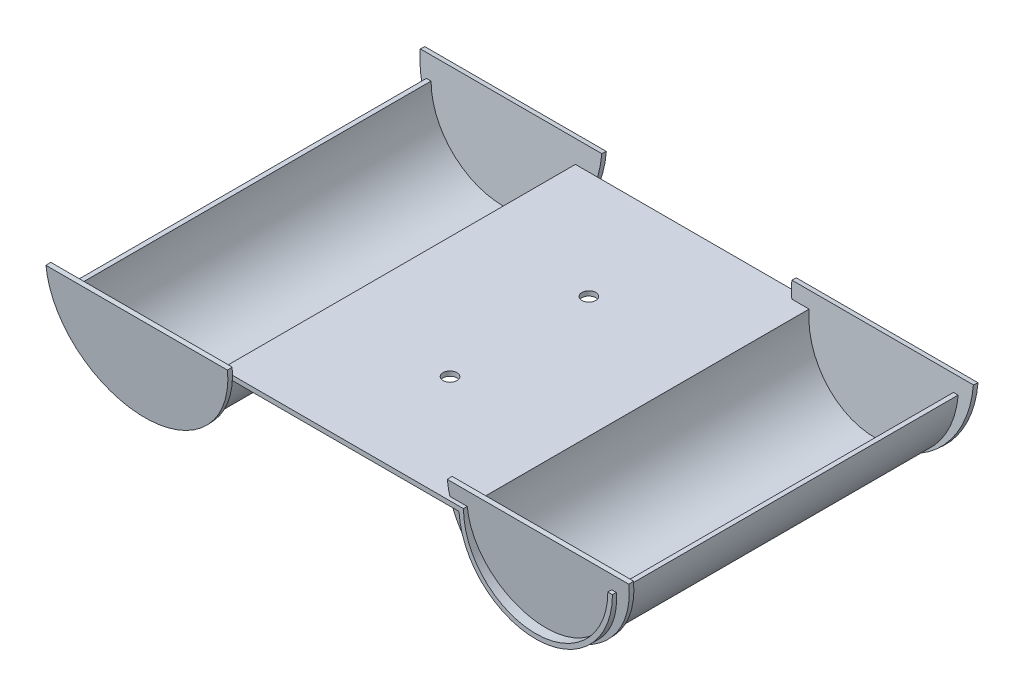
ISO-10303-21;
HEADER;
FILE_DESCRIPTION(('STEP AP214'),'2;1');
FILE_NAME('part.step','',(''),(''),'','','');
FILE_SCHEMA(('AUTOMOTIVE_DESIGN { 1 0 10303 214 1 1 1 1 }'));
ENDSEC;
DATA;
#1=APPLICATION_CONTEXT('core data for automotive mechanical design processes');
#2=APPLICATION_PROTOCOL_DEFINITION('international standard','automotive_design',2000,#1);
#3=PRODUCT_CONTEXT('',#1,'mechanical');
#4=PRODUCT('Part','Part','',(#3));
#5=PRODUCT_RELATED_PRODUCT_CATEGORY('part','',(#4));
#6=PRODUCT_DEFINITION_FORMATION('','',#4);
#7=PRODUCT_DEFINITION_CONTEXT('part definition',#1,'design');
#8=PRODUCT_DEFINITION('design','',#6,#7);
#9=PRODUCT_DEFINITION_SHAPE('','',#8);
#10=(LENGTH_UNIT() NAMED_UNIT(*) SI_UNIT(.MILLI.,.METRE.));
#11=(NAMED_UNIT(*) PLANE_ANGLE_UNIT() SI_UNIT($,.RADIAN.));
#12=(NAMED_UNIT(*) SI_UNIT($,.STERADIAN.) SOLID_ANGLE_UNIT());
#13=UNCERTAINTY_MEASURE_WITH_UNIT(LENGTH_MEASURE(1.E-05),#10,'distance_accuracy_value','');
#14=(GEOMETRIC_REPRESENTATION_CONTEXT(3) GLOBAL_UNCERTAINTY_ASSIGNED_CONTEXT((#13)) GLOBAL_UNIT_ASSIGNED_CONTEXT((#10,
#11,#12)) REPRESENTATION_CONTEXT('',''));
#15=CARTESIAN_POINT('',(0.,0.,0.));
#16=DIRECTION('',(0.,0.,1.));
#17=DIRECTION('',(1.,0.,0.));
#18=AXIS2_PLACEMENT_3D('',#15,#16,#17);
#19=CARTESIAN_POINT('',(114.685600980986,0.,76.5));
#20=DIRECTION('',(0.,-1.,0.));
#21=DIRECTION('',(1.,0.,0.));
#22=AXIS2_PLACEMENT_3D('',#19,#20,#21);
#23=PLANE('',#22);
#24=DIRECTION('',(0.,0.,-1.));
#25=VECTOR('',#24,1.);
#26=CARTESIAN_POINT('',(114.685600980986,0.,76.5));
#27=LINE('',#26,#25);
#28=CARTESIAN_POINT('',(114.685600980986,0.,-74.8532907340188));
#29=VERTEX_POINT('',#28);
#30=CARTESIAN_POINT('',(114.685600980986,0.,-76.5));
#31=VERTEX_POINT('',#30);
#32=EDGE_CURVE('E457',#29,#31,#27,.T.);
#33=ORIENTED_EDGE('',*,*,#32,.F.);
#34=DIRECTION('',(1.,0.,0.));
#35=VECTOR('',#34,1.);
#36=CARTESIAN_POINT('',(114.685600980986,0.,-74.8532907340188));
#37=LINE('',#36,#35);
#38=CARTESIAN_POINT('',(116.685600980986,0.,-74.8532907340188));
#39=VERTEX_POINT('',#38);
#40=EDGE_CURVE('E533',#29,#39,#37,.T.);
#41=ORIENTED_EDGE('',*,*,#40,.T.);
#42=DIRECTION('',(0.,0.,-1.));
#43=VECTOR('',#42,1.);
#44=CARTESIAN_POINT('',(116.685600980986,0.,76.5));
#45=LINE('',#44,#43);
#46=CARTESIAN_POINT('',(116.685600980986,0.,-76.5));
#47=VERTEX_POINT('',#46);
#48=EDGE_CURVE('E462',#39,#47,#45,.T.);
#49=ORIENTED_EDGE('',*,*,#48,.T.);
#50=DIRECTION('',(-1.,0.,0.));
#51=VECTOR('',#50,1.);
#52=CARTESIAN_POINT('',(114.685600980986,0.,-76.5));
#53=LINE('',#52,#51);
#54=EDGE_CURVE('E425',#47,#31,#53,.T.);
#55=ORIENTED_EDGE('',*,*,#54,.T.);
#56=EDGE_LOOP('',(#33,#41,#49,#55));
#57=FACE_BOUND('',#56,.T.);
#58=ADVANCED_FACE('F29',(#57),#23,.F.);
#59=CARTESIAN_POINT('',(83.5,0.,76.5));
#60=DIRECTION('',(0.,0.,-1.));
#61=DIRECTION('',(-1.,0.,0.));
#62=AXIS2_PLACEMENT_3D('',#59,#60,#61);
#63=CYLINDRICAL_SURFACE('',#62,31.1856009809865);
#64=DIRECTION('',(0.,0.,-1.));
#65=VECTOR('',#64,1.);
#66=CARTESIAN_POINT('',(52.3143990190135,0.,76.5));
#67=LINE('',#66,#65);
#68=CARTESIAN_POINT('',(52.3143990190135,0.,-74.8532907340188));
#69=VERTEX_POINT('',#68);
#70=CARTESIAN_POINT('',(52.3143990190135,0.,-76.5));
#71=VERTEX_POINT('',#70);
#72=EDGE_CURVE('E453',#69,#71,#67,.T.);
#73=ORIENTED_EDGE('',*,*,#72,.F.);
#74=CARTESIAN_POINT('',(83.5,0.,-74.8532907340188));
#75=DIRECTION('',(0.,-0.0871557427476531,-0.996194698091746));
#76=DIRECTION('',(0.,0.996194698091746,-0.0871557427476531));
#77=AXIS2_PLACEMENT_3D('',#74,#75,#76);
#78=ELLIPSE('',#77,31.3047249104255,31.1856009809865);
#79=EDGE_CURVE('E530',#69,#29,#78,.F.);
#80=ORIENTED_EDGE('',*,*,#79,.T.);
#81=ORIENTED_EDGE('',*,*,#32,.T.);
#82=CARTESIAN_POINT('',(83.5,0.,-76.5));
#83=DIRECTION('',(0.,0.,-1.));
#84=DIRECTION('',(1.,0.,0.));
#85=AXIS2_PLACEMENT_3D('',#82,#83,#84);
#86=CIRCLE('',#85,31.1856009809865);
#87=EDGE_CURVE('E428',#31,#71,#86,.T.);
#88=ORIENTED_EDGE('',*,*,#87,.T.);
#89=EDGE_LOOP('',(#73,#80,#81,#88));
#90=FACE_BOUND('',#89,.T.);
#91=ADVANCED_FACE('F619',(#90),#63,.F.);
#92=CARTESIAN_POINT('',(116.685600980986,0.,76.5));
#93=VERTEX_POINT('',#92);
#94=CARTESIAN_POINT('',(116.685600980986,0.,74.8532907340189));
#95=VERTEX_POINT('',#94);
#96=EDGE_CURVE('E464',#93,#95,#45,.T.);
#97=ORIENTED_EDGE('',*,*,#96,.T.);
#98=DIRECTION('',(-1.,0.,0.));
#99=VECTOR('',#98,1.);
#100=CARTESIAN_POINT('',(114.685600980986,0.,74.8532907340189));
#101=LINE('',#100,#99);
#102=CARTESIAN_POINT('',(114.685600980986,0.,74.8532907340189));
#103=VERTEX_POINT('',#102);
#104=EDGE_CURVE('E364',#95,#103,#101,.T.);
#105=ORIENTED_EDGE('',*,*,#104,.T.);
#106=CARTESIAN_POINT('',(114.685600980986,0.,76.5));
#107=VERTEX_POINT('',#106);
#108=EDGE_CURVE('E459',#107,#103,#27,.T.);
#109=ORIENTED_EDGE('',*,*,#108,.F.);
#110=DIRECTION('',(-1.,0.,0.));
#111=VECTOR('',#110,1.);
#112=CARTESIAN_POINT('',(114.685600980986,0.,76.5));
#113=LINE('',#112,#111);
#114=EDGE_CURVE('E444',#93,#107,#113,.T.);
#115=ORIENTED_EDGE('',*,*,#114,.F.);
#116=EDGE_LOOP('',(#97,#105,#109,#115));
#117=FACE_BOUND('',#116,.T.);
#118=ADVANCED_FACE('F620',(#117),#23,.F.);
#119=ORIENTED_EDGE('',*,*,#108,.T.);
#120=CARTESIAN_POINT('',(83.5,0.,74.8532907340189));
#121=DIRECTION('',(0.,-0.0871557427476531,0.996194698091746));
#122=DIRECTION('',(0.,-0.996194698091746,-0.0871557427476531));
#123=AXIS2_PLACEMENT_3D('',#120,#121,#122);
#124=ELLIPSE('',#123,31.3047249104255,31.1856009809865);
#125=CARTESIAN_POINT('',(52.3143990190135,0.,74.8532907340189));
#126=VERTEX_POINT('',#125);
#127=EDGE_CURVE('E361',#103,#126,#124,.F.);
#128=ORIENTED_EDGE('',*,*,#127,.T.);
#129=CARTESIAN_POINT('',(52.3143990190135,0.,76.5));
#130=VERTEX_POINT('',#129);
#131=EDGE_CURVE('E454',#130,#126,#67,.T.);
#132=ORIENTED_EDGE('',*,*,#131,.F.);
#133=CARTESIAN_POINT('',(83.5,0.,76.5));
#134=DIRECTION('',(0.,0.,-1.));
#135=DIRECTION('',(1.,0.,0.));
#136=AXIS2_PLACEMENT_3D('',#133,#134,#135);
#137=CIRCLE('',#136,31.1856009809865);
#138=EDGE_CURVE('E446',#107,#130,#137,.T.);
#139=ORIENTED_EDGE('',*,*,#138,.F.);
#140=EDGE_LOOP('',(#119,#128,#132,#139));
#141=FACE_BOUND('',#140,.T.);
#142=ADVANCED_FACE('F626',(#141),#63,.F.);
#143=CARTESIAN_POINT('',(-83.5,0.,76.5));
#144=DIRECTION('',(0.,0.,-1.));
#145=DIRECTION('',(-1.,0.,0.));
#146=AXIS2_PLACEMENT_3D('',#143,#144,#145);
#147=CYLINDRICAL_SURFACE('',#146,31.1856009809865);
#148=CARTESIAN_POINT('',(-83.5,0.,-76.5));
#149=DIRECTION('',(0.,0.,-1.));
#150=DIRECTION('',(-1.,0.,0.));
#151=AXIS2_PLACEMENT_3D('',#148,#149,#150);
#152=CIRCLE('',#151,31.1856009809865);
#153=CARTESIAN_POINT('',(-52.3143990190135,0.,-76.5));
#154=VERTEX_POINT('',#153);
#155=CARTESIAN_POINT('',(-114.685600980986,0.,-76.5));
#156=VERTEX_POINT('',#155);
#157=EDGE_CURVE('E412',#154,#156,#152,.T.);
#158=ORIENTED_EDGE('',*,*,#157,.T.);
#159=DIRECTION('',(0.,0.,-1.));
#160=VECTOR('',#159,1.);
#161=CARTESIAN_POINT('',(-114.685600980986,0.,76.5));
#162=LINE('',#161,#160);
#163=CARTESIAN_POINT('',(-114.685600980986,0.,76.5));
#164=VERTEX_POINT('',#163);
#165=EDGE_CURVE('E479',#164,#156,#162,.T.);
#166=ORIENTED_EDGE('',*,*,#165,.F.);
#167=CARTESIAN_POINT('',(-83.5,0.,76.5));
#168=DIRECTION('',(0.,0.,-1.));
#169=DIRECTION('',(-1.,0.,0.));
#170=AXIS2_PLACEMENT_3D('',#167,#168,#169);
#171=CIRCLE('',#170,31.1856009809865);
#172=CARTESIAN_POINT('',(-52.3143990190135,0.,76.5));
#173=VERTEX_POINT('',#172);
#174=EDGE_CURVE('E433',#173,#164,#171,.T.);
#175=ORIENTED_EDGE('',*,*,#174,.F.);
#176=DIRECTION('',(0.,0.,-1.));
#177=VECTOR('',#176,1.);
#178=CARTESIAN_POINT('',(-52.3143990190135,0.,76.5));
#179=LINE('',#178,#177);
#180=EDGE_CURVE('E450',#173,#154,#179,.T.);
#181=ORIENTED_EDGE('',*,*,#180,.T.);
#182=EDGE_LOOP('',(#158,#166,#175,#181));
#183=FACE_BOUND('',#182,.T.);
#184=ADVANCED_FACE('F31',(#183),#147,.F.);
#185=CARTESIAN_POINT('',(-114.685600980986,0.,76.5));
#186=DIRECTION('',(0.,-1.,0.));
#187=DIRECTION('',(1.,0.,0.));
#188=AXIS2_PLACEMENT_3D('',#185,#186,#187);
#189=PLANE('',#188);
#190=DIRECTION('',(-1.,0.,0.));
#191=VECTOR('',#190,1.);
#192=CARTESIAN_POINT('',(-114.685600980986,0.,-76.5));
#193=LINE('',#192,#191);
#194=CARTESIAN_POINT('',(-116.685600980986,0.,-76.5));
#195=VERTEX_POINT('',#194);
#196=EDGE_CURVE('E415',#156,#195,#193,.T.);
#197=ORIENTED_EDGE('',*,*,#196,.T.);
#198=DIRECTION('',(0.,0.,-1.));
#199=VECTOR('',#198,1.);
#200=CARTESIAN_POINT('',(-116.685600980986,0.,76.5));
#201=LINE('',#200,#199);
#202=CARTESIAN_POINT('',(-116.685600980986,0.,76.5));
#203=VERTEX_POINT('',#202);
#204=EDGE_CURVE('E476',#203,#195,#201,.T.);
#205=ORIENTED_EDGE('',*,*,#204,.F.);
#206=DIRECTION('',(-1.,0.,0.));
#207=VECTOR('',#206,1.);
#208=CARTESIAN_POINT('',(-114.685600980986,0.,76.5));
#209=LINE('',#208,#207);
#210=EDGE_CURVE('E436',#164,#203,#209,.T.);
#211=ORIENTED_EDGE('',*,*,#210,.F.);
#212=ORIENTED_EDGE('',*,*,#165,.T.);
#213=EDGE_LOOP('',(#197,#205,#211,#212));
#214=FACE_BOUND('',#213,.T.);
#215=ADVANCED_FACE('F643',(#214),#189,.F.);
#216=CARTESIAN_POINT('',(-83.5,0.,76.5));
#217=DIRECTION('',(0.,0.,-1.));
#218=DIRECTION('',(-1.,0.,0.));
#219=AXIS2_PLACEMENT_3D('',#216,#217,#218);
#220=CYLINDRICAL_SURFACE('',#219,33.1856009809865);
#221=CARTESIAN_POINT('',(-83.5,0.,-76.5));
#222=DIRECTION('',(0.,0.,1.));
#223=DIRECTION('',(-1.,0.,0.));
#224=AXIS2_PLACEMENT_3D('',#221,#222,#223);
#225=CIRCLE('',#224,33.1856009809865);
#226=CARTESIAN_POINT('',(-50.3747209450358,-2.,-76.5));
#227=VERTEX_POINT('',#226);
#228=EDGE_CURVE('E417',#195,#227,#225,.T.);
#229=ORIENTED_EDGE('',*,*,#228,.T.);
#230=DIRECTION('',(0.,0.,-1.));
#231=VECTOR('',#230,1.);
#232=CARTESIAN_POINT('',(-50.3747209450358,-2.,76.5));
#233=LINE('',#232,#231);
#234=CARTESIAN_POINT('',(-50.3747209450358,-2.,76.5));
#235=VERTEX_POINT('',#234);
#236=EDGE_CURVE('E472',#235,#227,#233,.T.);
#237=ORIENTED_EDGE('',*,*,#236,.F.);
#238=CARTESIAN_POINT('',(-83.5,0.,76.5));
#239=DIRECTION('',(0.,0.,1.));
#240=DIRECTION('',(-1.,0.,0.));
#241=AXIS2_PLACEMENT_3D('',#238,#239,#240);
#242=CIRCLE('',#241,33.1856009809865);
#243=EDGE_CURVE('E438',#203,#235,#242,.T.);
#244=ORIENTED_EDGE('',*,*,#243,.F.);
#245=ORIENTED_EDGE('',*,*,#204,.T.);
#246=EDGE_LOOP('',(#229,#237,#244,#245));
#247=FACE_BOUND('',#246,.T.);
#248=ADVANCED_FACE('F637',(#247),#220,.T.);
#249=CARTESIAN_POINT('',(-50.3747209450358,-2.,76.5));
#250=DIRECTION('',(0.,1.,0.));
#251=DIRECTION('',(0.,0.,1.));
#252=AXIS2_PLACEMENT_3D('',#249,#250,#251);
#253=PLANE('',#252);
#254=CARTESIAN_POINT('',(0.,-2.,-30.));
#255=DIRECTION('',(0.,1.,0.));
#256=DIRECTION('',(0.,0.,1.));
#257=AXIS2_PLACEMENT_3D('',#254,#255,#256);
#258=CIRCLE('',#257,3.);
#259=CARTESIAN_POINT('',(0.,-2.,-27.));
#260=VERTEX_POINT('',#259);
#261=EDGE_CURVE('E829',#260,#260,#258,.F.);
#262=ORIENTED_EDGE('',*,*,#261,.F.);
#263=EDGE_LOOP('',(#262));
#264=FACE_BOUND('',#263,.T.);
#265=CARTESIAN_POINT('',(0.,-2.,30.));
#266=DIRECTION('',(0.,1.,0.));
#267=DIRECTION('',(0.,0.,1.));
#268=AXIS2_PLACEMENT_3D('',#265,#266,#267);
#269=CIRCLE('',#268,3.);
#270=CARTESIAN_POINT('',(0.,-2.,33.));
#271=VERTEX_POINT('',#270);
#272=EDGE_CURVE('E271',#271,#271,#269,.F.);
#273=ORIENTED_EDGE('',*,*,#272,.F.);
#274=EDGE_LOOP('',(#273));
#275=FACE_BOUND('',#274,.T.);
#276=DIRECTION('',(0.,0.,-1.));
#277=VECTOR('',#276,1.);
#278=CARTESIAN_POINT('',(50.3747209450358,-1.99999999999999,76.5));
#279=LINE('',#278,#277);
#280=CARTESIAN_POINT('',(50.3747209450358,-1.99999999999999,-74.678313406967));
#281=VERTEX_POINT('',#280);
#282=CARTESIAN_POINT('',(50.3747209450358,-1.99999999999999,-76.5));
#283=VERTEX_POINT('',#282);
#284=EDGE_CURVE('E467',#281,#283,#279,.T.);
#285=ORIENTED_EDGE('',*,*,#284,.F.);
#286=DIRECTION('',(-1.,0.,0.));
#287=VECTOR('',#286,1.);
#288=CARTESIAN_POINT('',(-50.3747209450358,-2.,-74.678313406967));
#289=LINE('',#288,#287);
#290=CARTESIAN_POINT('',(45.1905122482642,-2.,-74.678313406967));
#291=VERTEX_POINT('',#290);
#292=EDGE_CURVE('E539',#281,#291,#289,.T.);
#293=ORIENTED_EDGE('',*,*,#292,.T.);
#294=CARTESIAN_POINT('',(83.5,-2.,-171.087816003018));
#295=DIRECTION('',(0.,1.,0.));
#296=DIRECTION('',(0.,0.,-1.));
#297=AXIS2_PLACEMENT_3D('',#294,#295,#296);
#298=ELLIPSE('',#297,450.00091181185,39.2201637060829);
#299=CARTESIAN_POINT('',(45.229310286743,-2.,-72.6706737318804));
#300=VERTEX_POINT('',#299);
#301=EDGE_CURVE('E292',#291,#300,#298,.T.);
#302=ORIENTED_EDGE('',*,*,#301,.T.);
#303=DIRECTION('',(1.,0.,0.));
#304=VECTOR('',#303,1.);
#305=CARTESIAN_POINT('',(-50.3747209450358,-2.,-72.6706737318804));
#306=LINE('',#305,#304);
#307=CARTESIAN_POINT('',(50.3747209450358,-1.99999999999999,-72.6706737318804));
#308=VERTEX_POINT('',#307);
#309=EDGE_CURVE('E527',#300,#308,#306,.T.);
#310=ORIENTED_EDGE('',*,*,#309,.T.);
#311=CARTESIAN_POINT('',(50.3747209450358,-1.99999999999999,72.6706737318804));
#312=VERTEX_POINT('',#311);
#313=EDGE_CURVE('E473',#312,#308,#279,.T.);
#314=ORIENTED_EDGE('',*,*,#313,.F.);
#315=DIRECTION('',(-1.,0.,0.));
#316=VECTOR('',#315,1.);
#317=CARTESIAN_POINT('',(-50.3747209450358,-2.,72.6706737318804));
#318=LINE('',#317,#316);
#319=CARTESIAN_POINT('',(45.229310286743,-2.,72.6706737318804));
#320=VERTEX_POINT('',#319);
#321=EDGE_CURVE('E358',#312,#320,#318,.T.);
#322=ORIENTED_EDGE('',*,*,#321,.T.);
#323=CARTESIAN_POINT('',(83.5,-2.,171.087816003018));
#324=DIRECTION('',(0.,1.,0.));
#325=DIRECTION('',(0.,0.,1.));
#326=AXIS2_PLACEMENT_3D('',#323,#324,#325);
#327=ELLIPSE('',#326,450.00091181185,39.2201637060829);
#328=CARTESIAN_POINT('',(45.1905122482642,-2.,74.678313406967));
#329=VERTEX_POINT('',#328);
#330=EDGE_CURVE('E345',#320,#329,#327,.T.);
#331=ORIENTED_EDGE('',*,*,#330,.T.);
#332=DIRECTION('',(1.,0.,0.));
#333=VECTOR('',#332,1.);
#334=CARTESIAN_POINT('',(-50.3747209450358,-2.,74.678313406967));
#335=LINE('',#334,#333);
#336=CARTESIAN_POINT('',(50.3747209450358,-1.99999999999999,74.678313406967));
#337=VERTEX_POINT('',#336);
#338=EDGE_CURVE('E371',#329,#337,#335,.T.);
#339=ORIENTED_EDGE('',*,*,#338,.T.);
#340=CARTESIAN_POINT('',(50.3747209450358,-1.99999999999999,76.5));
#341=VERTEX_POINT('',#340);
#342=EDGE_CURVE('E469',#341,#337,#279,.T.);
#343=ORIENTED_EDGE('',*,*,#342,.F.);
#344=DIRECTION('',(1.,0.,0.));
#345=VECTOR('',#344,1.);
#346=CARTESIAN_POINT('',(-50.3747209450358,-2.,76.5));
#347=LINE('',#346,#345);
#348=EDGE_CURVE('E440',#235,#341,#347,.T.);
#349=ORIENTED_EDGE('',*,*,#348,.F.);
#350=ORIENTED_EDGE('',*,*,#236,.T.);
#351=DIRECTION('',(1.,0.,0.));
#352=VECTOR('',#351,1.);
#353=CARTESIAN_POINT('',(-50.3747209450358,-2.,-76.5));
#354=LINE('',#353,#352);
#355=EDGE_CURVE('E419',#227,#283,#354,.T.);
#356=ORIENTED_EDGE('',*,*,#355,.T.);
#357=EDGE_LOOP('',(#285,#293,#302,#310,#314,#322,#331,#339,#343,#349,#350,#356));
#358=FACE_BOUND('',#357,.T.);
#359=ADVANCED_FACE('F586',(#264,#275,#358),#253,.F.);
#360=CARTESIAN_POINT('',(83.5,0.,76.5));
#361=DIRECTION('',(0.,0.,-1.));
#362=DIRECTION('',(-1.,0.,0.));
#363=AXIS2_PLACEMENT_3D('',#360,#361,#362);
#364=CYLINDRICAL_SURFACE('',#363,33.1856009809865);
#365=CARTESIAN_POINT('',(52.2305688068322,-11.1133606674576,-3.628798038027));
#366=CARTESIAN_POINT('',(52.2751524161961,-11.2387994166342,-4.38692369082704));
#367=CARTESIAN_POINT('',(52.3210872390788,-11.3656593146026,-5.14473391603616));
#368=CARTESIAN_POINT('',(52.4158614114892,-11.6223568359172,-6.65967216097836));
#369=CARTESIAN_POINT('',(52.4647007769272,-11.7521944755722,-7.41680017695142));
#370=CARTESIAN_POINT('',(52.6158841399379,-12.1463908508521,-9.68716233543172));
#371=CARTESIAN_POINT('',(52.7228880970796,-12.415418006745,-11.1992835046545));
#372=CARTESIAN_POINT('',(52.951394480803,-12.9675060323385,-14.2221873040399));
#373=CARTESIAN_POINT('',(53.0729180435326,-13.2505870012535,-15.7329646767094));
#374=CARTESIAN_POINT('',(53.3326555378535,-13.8317307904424,-18.7501813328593));
#375=CARTESIAN_POINT('',(53.4708691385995,-14.1297933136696,-20.2566207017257));
#376=CARTESIAN_POINT('',(53.7686905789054,-14.7462564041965,-23.2833756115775));
#377=CARTESIAN_POINT('',(53.928548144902,-15.0648674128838,-24.8036239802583));
#378=CARTESIAN_POINT('',(54.2718757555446,-15.7206210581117,-27.8375198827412));
#379=CARTESIAN_POINT('',(54.4553464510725,-16.057764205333,-29.3511672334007));
#380=CARTESIAN_POINT('',(54.8502429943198,-16.7521647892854,-32.3692773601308));
#381=CARTESIAN_POINT('',(55.0616526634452,-17.109410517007,-33.8737449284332));
#382=CARTESIAN_POINT('',(55.5180415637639,-17.8460689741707,-36.8721040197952));
#383=CARTESIAN_POINT('',(55.7630183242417,-18.2254800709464,-38.3659963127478));
#384=CARTESIAN_POINT('',(56.1650050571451,-18.8186410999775,-40.6194040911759));
#385=CARTESIAN_POINT('',(56.3071028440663,-19.0235554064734,-41.3839234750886));
#386=CARTESIAN_POINT('',(56.6032544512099,-19.4400247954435,-42.9088194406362));
#387=CARTESIAN_POINT('',(56.7573079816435,-19.6515797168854,-43.669196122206));
#388=CARTESIAN_POINT('',(57.0786948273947,-20.0816035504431,-45.1853404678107));
#389=CARTESIAN_POINT('',(57.2460306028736,-20.3000737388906,-45.9411072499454));
#390=CARTESIAN_POINT('',(57.5954317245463,-20.7440902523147,-47.4471499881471));
#391=CARTESIAN_POINT('',(57.7774970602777,-20.9696365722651,-48.1974259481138));
#392=CARTESIAN_POINT('',(58.1577421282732,-21.4276116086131,-49.6904793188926));
#393=CARTESIAN_POINT('',(58.3558972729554,-21.6600294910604,-50.4332662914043));
#394=CARTESIAN_POINT('',(58.7704493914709,-22.1321519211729,-51.911433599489));
#395=CARTESIAN_POINT('',(58.9868466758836,-22.371856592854,-52.6468138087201));
#396=CARTESIAN_POINT('',(59.4399589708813,-22.8584566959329,-54.1086736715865));
#397=CARTESIAN_POINT('',(59.6766686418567,-23.1053502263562,-54.8351556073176));
#398=CARTESIAN_POINT('',(60.1728618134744,-23.6062079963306,-56.277830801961));
#399=CARTESIAN_POINT('',(60.4323439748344,-23.8601718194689,-56.9940246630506));
#400=CARTESIAN_POINT('',(60.8908411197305,-24.2935310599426,-58.1899735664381));
#401=CARTESIAN_POINT('',(61.083076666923,-24.4711500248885,-58.6729766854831));
#402=CARTESIAN_POINT('',(61.4804487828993,-24.8293183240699,-59.6325391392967));
#403=CARTESIAN_POINT('',(61.6855848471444,-25.0098675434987,-60.1090987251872));
#404=CARTESIAN_POINT('',(62.1098431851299,-25.3736755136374,-61.0550694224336));
#405=CARTESIAN_POINT('',(62.3289688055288,-25.5569349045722,-61.5244787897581));
#406=CARTESIAN_POINT('',(62.7822473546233,-25.9257441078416,-62.4550372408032));
#407=CARTESIAN_POINT('',(63.0163991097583,-26.1112937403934,-62.9161869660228));
#408=CARTESIAN_POINT('',(63.5005286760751,-26.4839276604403,-63.8284361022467));
#409=CARTESIAN_POINT('',(63.7504808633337,-26.6710090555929,-64.2795502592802));
#410=CARTESIAN_POINT('',(64.2677317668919,-27.0463689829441,-65.1711672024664));
#411=CARTESIAN_POINT('',(64.5350287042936,-27.2346473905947,-65.6116710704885));
#412=CARTESIAN_POINT('',(65.0881011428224,-27.6115560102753,-66.4804349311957));
#413=CARTESIAN_POINT('',(65.3738668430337,-27.8001859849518,-66.9087012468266));
#414=CARTESIAN_POINT('',(65.9653043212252,-28.1769677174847,-67.7516259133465));
#415=CARTESIAN_POINT('',(66.2709795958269,-28.3651193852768,-68.1662818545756));
#416=CARTESIAN_POINT('',(66.9818810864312,-28.7862181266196,-69.0809525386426));
#417=CARTESIAN_POINT('',(67.3929971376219,-29.0187037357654,-69.5766366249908));
#418=CARTESIAN_POINT('',(68.2501856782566,-29.4781890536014,-70.5393547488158));
#419=CARTESIAN_POINT('',(68.6962481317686,-29.7051903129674,-71.0063969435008));
#420=CARTESIAN_POINT('',(69.6248539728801,-30.1501124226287,-71.9067309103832));
#421=CARTESIAN_POINT('',(70.1073693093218,-30.3680400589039,-72.3400481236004));
#422=CARTESIAN_POINT('',(71.1101658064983,-30.7907774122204,-73.1677101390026));
#423=CARTESIAN_POINT('',(71.6304388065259,-30.9955899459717,-73.5620633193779));
#424=CARTESIAN_POINT('',(72.6009934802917,-31.3481498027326,-74.2314793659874));
#425=CARTESIAN_POINT('',(73.0445189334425,-31.4991278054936,-74.5146418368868));
#426=CARTESIAN_POINT('',(73.9549009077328,-31.7868362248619,-75.048795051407));
#427=CARTESIAN_POINT('',(74.4217516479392,-31.9235701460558,-75.2997937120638));
#428=CARTESIAN_POINT('',(75.3773010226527,-32.1799700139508,-75.7663171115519));
#429=CARTESIAN_POINT('',(75.8659950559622,-32.2996395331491,-75.9818492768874));
#430=CARTESIAN_POINT('',(76.8630276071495,-32.519151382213,-76.3743123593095));
#431=CARTESIAN_POINT('',(77.3713662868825,-32.6189935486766,-76.5512429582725));
#432=CARTESIAN_POINT('',(78.4087714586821,-32.7969919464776,-76.864890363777));
#433=CARTESIAN_POINT('',(78.9379743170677,-32.8749625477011,-77.001263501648));
#434=CARTESIAN_POINT('',(80.0090103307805,-33.0058798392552,-77.2293578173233));
#435=CARTESIAN_POINT('',(80.5508436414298,-33.0588262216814,-77.321078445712));
#436=CARTESIAN_POINT('',(81.6420100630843,-33.1380603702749,-77.4580744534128));
#437=CARTESIAN_POINT('',(82.1913390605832,-33.1643622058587,-77.5033743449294));
#438=CARTESIAN_POINT('',(83.2924546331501,-33.1895191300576,-77.5467070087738));
#439=CARTESIAN_POINT('',(83.8442409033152,-33.1883775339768,-77.5447454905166));
#440=CARTESIAN_POINT('',(84.8730632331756,-33.1606420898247,-77.4969616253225));
#441=CARTESIAN_POINT('',(85.350469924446,-33.1373844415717,-77.4568883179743));
#442=CARTESIAN_POINT('',(86.2995591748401,-33.0707244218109,-77.341665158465));
#443=CARTESIAN_POINT('',(86.7712423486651,-33.0273242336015,-77.2665191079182));
#444=CARTESIAN_POINT('',(87.7057150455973,-32.9213797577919,-77.0822379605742));
#445=CARTESIAN_POINT('',(88.168504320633,-32.8588349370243,-76.973101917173));
#446=CARTESIAN_POINT('',(89.0823795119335,-32.7159760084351,-76.7223481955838));
#447=CARTESIAN_POINT('',(89.5334648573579,-32.6356610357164,-76.5807289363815));
#448=CARTESIAN_POINT('',(90.4268280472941,-32.4578661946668,-76.2649847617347));
#449=CARTESIAN_POINT('',(90.8689378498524,-32.3601939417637,-76.0904940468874));
#450=CARTESIAN_POINT('',(91.7368200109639,-32.1502453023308,-75.712286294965));
#451=CARTESIAN_POINT('',(92.1625927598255,-32.0379692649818,-75.5085699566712));
#452=CARTESIAN_POINT('',(92.9964623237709,-31.8007742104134,-75.0741679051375));
#453=CARTESIAN_POINT('',(93.4045587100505,-31.6758548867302,-74.8434815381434));
#454=CARTESIAN_POINT('',(94.202259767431,-31.4153131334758,-74.3574268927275));
#455=CARTESIAN_POINT('',(94.5918601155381,-31.2796882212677,-74.1020528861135));
#456=CARTESIAN_POINT('',(95.5664223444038,-30.9206536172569,-73.4185746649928));
#457=CARTESIAN_POINT('',(96.1377220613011,-30.6908525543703,-72.9742442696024));
#458=CARTESIAN_POINT('',(97.2340560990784,-30.216173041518,-72.0389706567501));
#459=CARTESIAN_POINT('',(97.7590684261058,-29.9712875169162,-71.5480055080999));
#460=CARTESIAN_POINT('',(98.7652281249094,-29.4715620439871,-70.5260844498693));
#461=CARTESIAN_POINT('',(99.2463000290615,-29.2167060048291,-69.9950624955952));
#462=CARTESIAN_POINT('',(100.166239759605,-28.7018895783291,-68.9001925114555));
#463=CARTESIAN_POINT('',(100.605109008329,-28.4419293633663,-68.3363455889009));
#464=CARTESIAN_POINT('',(101.377927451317,-27.9613477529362,-67.2720252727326));
#465=CARTESIAN_POINT('',(101.717527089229,-27.740963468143,-66.7755154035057));
#466=CARTESIAN_POINT('',(102.371096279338,-27.3005705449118,-65.7656601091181));
#467=CARTESIAN_POINT('',(102.68506187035,-27.0805619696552,-65.2523120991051));
#468=CARTESIAN_POINT('',(103.289485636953,-26.6420691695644,-64.21088253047));
#469=CARTESIAN_POINT('',(103.579928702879,-26.4235860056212,-63.6827917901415));
#470=CARTESIAN_POINT('',(104.139009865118,-25.9892415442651,-62.6142049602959));
#471=CARTESIAN_POINT('',(104.40764884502,-25.7733801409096,-62.073709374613));
#472=CARTESIAN_POINT('',(104.927234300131,-25.3430959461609,-60.9771939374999));
#473=CARTESIAN_POINT('',(105.178004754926,-25.1287024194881,-60.421079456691));
#474=CARTESIAN_POINT('',(105.660979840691,-24.703815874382,-59.2994004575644));
#475=CARTESIAN_POINT('',(105.893184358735,-24.4933228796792,-58.7338358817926));
#476=CARTESIAN_POINT('',(106.340517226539,-24.0767161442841,-57.5948185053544));
#477=CARTESIAN_POINT('',(106.555654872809,-23.870600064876,-57.0213702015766));
#478=CARTESIAN_POINT('',(106.970459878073,-23.4628669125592,-55.8673456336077));
#479=CARTESIAN_POINT('',(107.170127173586,-23.2612498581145,-55.2867693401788));
#480=CARTESIAN_POINT('',(107.704163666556,-22.7086858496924,-53.6684361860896));
#481=CARTESIAN_POINT('',(108.023433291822,-22.3627015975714,-52.6239802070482));
#482=CARTESIAN_POINT('',(108.624221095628,-21.6855317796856,-50.5194396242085));
#483=CARTESIAN_POINT('',(108.905732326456,-21.3543489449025,-49.4593521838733));
#484=CARTESIAN_POINT('',(109.436577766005,-20.7063648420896,-47.3259982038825));
#485=CARTESIAN_POINT('',(109.685889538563,-20.3895737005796,-46.2527230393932));
#486=CARTESIAN_POINT('',(110.15665601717,-19.7701303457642,-44.0961467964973));
#487=CARTESIAN_POINT('',(110.378112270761,-19.4674773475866,-43.012846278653));
#488=CARTESIAN_POINT('',(110.797920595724,-18.8743264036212,-40.8332021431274));
#489=CARTESIAN_POINT('',(110.996166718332,-18.5838878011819,-39.736822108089));
#490=CARTESIAN_POINT('',(111.371661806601,-18.0158391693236,-37.5371741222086));
#491=CARTESIAN_POINT('',(111.548910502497,-17.7382293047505,-36.4339060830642));
#492=CARTESIAN_POINT('',(111.885071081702,-17.1951669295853,-34.222028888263));
#493=CARTESIAN_POINT('',(112.043989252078,-16.9297102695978,-33.1134217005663));
#494=CARTESIAN_POINT('',(112.345852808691,-16.4100929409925,-30.8914161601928));
#495=CARTESIAN_POINT('',(112.488798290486,-16.1559322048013,-29.7780178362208));
#496=CARTESIAN_POINT('',(112.751271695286,-15.6753588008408,-27.6242026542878));
#497=CARTESIAN_POINT('',(112.87173509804,-15.4482420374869,-26.5840560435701));
#498=CARTESIAN_POINT('',(113.101845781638,-15.0025905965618,-24.5007219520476));
#499=CARTESIAN_POINT('',(113.211492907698,-14.7840560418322,-23.4575344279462));
#500=CARTESIAN_POINT('',(113.42113923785,-14.3550179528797,-21.3684462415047));
#501=CARTESIAN_POINT('',(113.521137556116,-14.1445151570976,-20.3225453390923));
#502=CARTESIAN_POINT('',(113.712481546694,-13.7310580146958,-18.2284615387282));
#503=CARTESIAN_POINT('',(113.803827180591,-13.528103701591,-17.1802786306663));
#504=CARTESIAN_POINT('',(113.977866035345,-13.1312703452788,-15.0924247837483));
#505=CARTESIAN_POINT('',(114.060636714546,-12.9373207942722,-14.0527736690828));
#506=CARTESIAN_POINT('',(114.21929815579,-12.5559338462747,-11.9717518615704));
#507=CARTESIAN_POINT('',(114.295188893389,-12.3684964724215,-10.9303811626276));
#508=CARTESIAN_POINT('',(114.440726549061,-11.9997860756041,-8.84640473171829));
#509=CARTESIAN_POINT('',(114.510375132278,-11.8185114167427,-7.80379940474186));
#510=CARTESIAN_POINT('',(114.644009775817,-11.4617138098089,-5.71725871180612));
#511=CARTESIAN_POINT('',(114.707995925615,-11.2861907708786,-4.67332336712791));
#512=CARTESIAN_POINT('',(114.769431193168,-11.1133606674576,-3.62879803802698));
#513=B_SPLINE_CURVE_WITH_KNOTS('',3,(#365,#366,#367,#368,#369,#370,#371,#372,#373,#374,#375,
#376,#377,#378,#379,#380,#381,#382,#383,#384,#385,#386,#387,#388,#389,#390,#391,#392,#393,#394,
#395,#396,#397,#398,#399,#400,#401,#402,#403,#404,#405,#406,#407,#408,#409,#410,#411,#412,#413,
#414,#415,#416,#417,#418,#419,#420,#421,#422,#423,#424,#425,#426,#427,#428,#429,#430,#431,#432,
#433,#434,#435,#436,#437,#438,#439,#440,#441,#442,#443,#444,#445,#446,#447,#448,#449,#450,#451,
#452,#453,#454,#455,#456,#457,#458,#459,#460,#461,#462,#463,#464,#465,#466,#467,#468,#469,#470,
#471,#472,#473,#474,#475,#476,#477,#478,#479,#480,#481,#482,#483,#484,#485,#486,#487,#488,#489,
#490,#491,#492,#493,#494,#495,#496,#497,#498,#499,#500,#501,#502,#503,#504,#505,#506,#507,#508,
#509,#510,#511,#512),.UNSPECIFIED.,.F.,.F.,(4,2,2,2,2,2,2,2,2,2,2,2,2,2,2,2,2,2,2,2,2,2,2,2,2,2,
2,2,2,2,2,2,2,2,2,2,2,2,2,2,2,2,2,2,2,2,2,2,2,2,2,2,2,2,2,2,2,2,2,2,2,2,2,2,2,2,2,2,2,2,2,2,2,
4),(0.,2.30917105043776,4.61835475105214,9.23699954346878,13.8624515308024,18.4878118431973,
23.1719949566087,27.8563072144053,32.537918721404,37.2191858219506,39.6315587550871,
42.043873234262,44.4566355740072,46.8693961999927,49.2785367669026,51.6877183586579,
54.0962685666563,56.5046772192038,58.1525824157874,59.8004232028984,61.4486596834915,
63.0967675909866,64.7422680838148,66.3876000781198,68.0320659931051,69.6768215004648,
71.7294304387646,73.781452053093,75.8319103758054,77.8819268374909,79.5227789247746,
81.1632263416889,82.8033298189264,84.4434468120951,86.0970895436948,87.7507526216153,
89.4035420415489,91.0561317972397,92.4933641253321,93.9304407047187,95.3675573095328,
96.8047438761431,98.2589854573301,99.7131922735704,101.167434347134,102.622014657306,
104.896475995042,107.172012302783,109.451386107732,111.73068306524,113.651831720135,
115.573276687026,117.495946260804,119.418537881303,121.358007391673,123.297488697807,
125.235906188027,127.174331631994,130.610236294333,134.046772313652,137.48569009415,
140.924416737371,144.378274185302,147.832176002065,151.284889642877,154.737582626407,
157.951822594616,161.166108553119,164.380689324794,167.5952843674,170.777701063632,
173.960129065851,177.141705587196,180.32323182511),.UNSPECIFIED.);
#514=CARTESIAN_POINT('',(68.0192042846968,-29.3535189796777,-70.2775509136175));
#515=VERTEX_POINT('',#514);
#516=CARTESIAN_POINT('',(69.9644575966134,-30.2997228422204,-72.2024084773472));
#517=VERTEX_POINT('',#516);
#518=EDGE_CURVE('E291',#515,#517,#513,.T.);
#519=ORIENTED_EDGE('',*,*,#518,.T.);
#520=CARTESIAN_POINT('',(83.5,0.,-74.8532907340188));
#521=DIRECTION('',(0.,-0.0871557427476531,-0.996194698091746));
#522=DIRECTION('',(0.,0.996194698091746,-0.0871557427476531));
#523=AXIS2_PLACEMENT_3D('',#520,#521,#522);
#524=ELLIPSE('',#523,33.3123645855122,33.1856009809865);
#525=EDGE_CURVE('E538',#517,#281,#524,.T.);
#526=ORIENTED_EDGE('',*,*,#525,.T.);
#527=ORIENTED_EDGE('',*,*,#284,.T.);
#528=CARTESIAN_POINT('',(83.5,0.,-76.5));
#529=DIRECTION('',(0.,0.,1.));
#530=DIRECTION('',(1.,0.,0.));
#531=AXIS2_PLACEMENT_3D('',#528,#529,#530);
#532=CIRCLE('',#531,33.1856009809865);
#533=EDGE_CURVE('E422',#283,#47,#532,.T.);
#534=ORIENTED_EDGE('',*,*,#533,.T.);
#535=ORIENTED_EDGE('',*,*,#48,.F.);
#536=CARTESIAN_POINT('',(97.0355424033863,-30.2997228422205,-72.2024084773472));
#537=VERTEX_POINT('',#536);
#538=EDGE_CURVE('E536',#39,#537,#524,.T.);
#539=ORIENTED_EDGE('',*,*,#538,.T.);
#540=CARTESIAN_POINT('',(98.9807957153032,-29.3535189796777,-70.2775509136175));
#541=VERTEX_POINT('',#540);
#542=EDGE_CURVE('E257',#537,#541,#513,.T.);
#543=ORIENTED_EDGE('',*,*,#542,.T.);
#544=CARTESIAN_POINT('',(83.5,0.,-72.8456510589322));
#545=DIRECTION('',(0.,0.0871557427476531,0.996194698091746));
#546=DIRECTION('',(0.,0.996194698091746,-0.0871557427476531));
#547=AXIS2_PLACEMENT_3D('',#544,#545,#546);
#548=ELLIPSE('',#547,33.3123645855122,33.1856009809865);
#549=CARTESIAN_POINT('',(116.685600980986,0.,-72.8456510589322));
#550=VERTEX_POINT('',#549);
#551=EDGE_CURVE('E520',#541,#550,#548,.T.);
#552=ORIENTED_EDGE('',*,*,#551,.T.);
#553=CARTESIAN_POINT('',(116.685600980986,0.,72.8456510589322));
#554=VERTEX_POINT('',#553);
#555=EDGE_CURVE('E468',#554,#550,#45,.T.);
#556=ORIENTED_EDGE('',*,*,#555,.F.);
#557=CARTESIAN_POINT('',(83.5,0.,72.8456510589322));
#558=DIRECTION('',(0.,0.0871557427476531,-0.996194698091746));
#559=DIRECTION('',(0.,-0.996194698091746,-0.0871557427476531));
#560=AXIS2_PLACEMENT_3D('',#557,#558,#559);
#561=ELLIPSE('',#560,33.3123645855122,33.1856009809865);
#562=CARTESIAN_POINT('',(98.9807957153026,-29.353518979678,70.2775509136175));
#563=VERTEX_POINT('',#562);
#564=EDGE_CURVE('E354',#554,#563,#561,.T.);
#565=ORIENTED_EDGE('',*,*,#564,.T.);
#566=CARTESIAN_POINT('',(98.9807957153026,-29.353518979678,70.2775509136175));
#567=CARTESIAN_POINT('',(98.8276420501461,-29.4342898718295,70.4458726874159));
#568=CARTESIAN_POINT('',(98.6722854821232,-29.5146926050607,70.6123747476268));
#569=CARTESIAN_POINT('',(98.3571954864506,-29.674552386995,70.9414119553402));
#570=CARTESIAN_POINT('',(98.1974650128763,-29.7540100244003,71.1039496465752));
#571=CARTESIAN_POINT('',(97.873452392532,-29.9118781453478,71.4249551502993));
#572=CARTESIAN_POINT('',(97.7091701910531,-29.990288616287,71.5834229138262));
#573=CARTESIAN_POINT('',(97.3758871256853,-30.1459401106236,71.8961560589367));
#574=CARTESIAN_POINT('',(97.2068832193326,-30.2231803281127,72.0504185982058));
#575=CARTESIAN_POINT('',(97.0355424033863,-30.2997228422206,72.2024084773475));
#576=B_SPLINE_CURVE_WITH_KNOTS('',3,(#566,#567,#568,#569,#570,#571,#572,#573,#574,#575),
.UNSPECIFIED.,.F.,.F.,(4,2,2,2,4),(0.,0.724428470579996,1.44837918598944,2.17233860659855,
2.89677579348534),.UNSPECIFIED.);
#577=CARTESIAN_POINT('',(97.035542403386,-30.2997228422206,72.2024084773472));
#578=VERTEX_POINT('',#577);
#579=EDGE_CURVE('E339',#563,#578,#576,.T.);
#580=ORIENTED_EDGE('',*,*,#579,.T.);
#581=CARTESIAN_POINT('',(83.5,0.,74.8532907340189));
#582=DIRECTION('',(0.,-0.0871557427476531,0.996194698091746));
#583=DIRECTION('',(0.,-0.996194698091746,-0.0871557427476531));
#584=AXIS2_PLACEMENT_3D('',#581,#582,#583);
#585=ELLIPSE('',#584,33.3123645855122,33.1856009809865);
#586=EDGE_CURVE('E367',#578,#95,#585,.T.);
#587=ORIENTED_EDGE('',*,*,#586,.T.);
#588=ORIENTED_EDGE('',*,*,#96,.F.);
#589=CARTESIAN_POINT('',(83.5,0.,76.5));
#590=DIRECTION('',(0.,0.,1.));
#591=DIRECTION('',(1.,0.,0.));
#592=AXIS2_PLACEMENT_3D('',#589,#590,#591);
#593=CIRCLE('',#592,33.1856009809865);
#594=EDGE_CURVE('E442',#341,#93,#593,.T.);
#595=ORIENTED_EDGE('',*,*,#594,.F.);
#596=ORIENTED_EDGE('',*,*,#342,.T.);
#597=CARTESIAN_POINT('',(69.964457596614,-30.2997228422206,72.2024084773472));
#598=VERTEX_POINT('',#597);
#599=EDGE_CURVE('E370',#337,#598,#585,.T.);
#600=ORIENTED_EDGE('',*,*,#599,.T.);
#601=CARTESIAN_POINT('',(69.964457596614,-30.2997228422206,72.2024084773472));
#602=CARTESIAN_POINT('',(69.7931167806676,-30.2231803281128,72.0504185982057));
#603=CARTESIAN_POINT('',(69.6241128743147,-30.1459401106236,71.8961560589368));
#604=CARTESIAN_POINT('',(69.2908298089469,-29.9902886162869,71.5834229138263));
#605=CARTESIAN_POINT('',(69.1265476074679,-29.9118781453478,71.4249551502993));
#606=CARTESIAN_POINT('',(68.8025349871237,-29.7540100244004,71.1039496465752));
#607=CARTESIAN_POINT('',(68.6428045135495,-29.6745523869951,70.9414119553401));
#608=CARTESIAN_POINT('',(68.3277145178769,-29.5146926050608,70.6123747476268));
#609=CARTESIAN_POINT('',(68.1723579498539,-29.4342898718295,70.445872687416));
#610=CARTESIAN_POINT('',(68.019204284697,-29.3535189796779,70.2775509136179));
#611=B_SPLINE_CURVE_WITH_KNOTS('',3,(#601,#602,#603,#604,#605,#606,#607,#608,#609,#610),
.UNSPECIFIED.,.F.,.F.,(4,2,2,2,4),(0.,0.724437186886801,1.44839660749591,2.17234732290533,
2.89677579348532),.UNSPECIFIED.);
#612=CARTESIAN_POINT('',(68.0192042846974,-29.353518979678,70.2775509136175));
#613=VERTEX_POINT('',#612);
#614=EDGE_CURVE('E333',#598,#613,#611,.T.);
#615=ORIENTED_EDGE('',*,*,#614,.T.);
#616=EDGE_CURVE('E357',#613,#312,#561,.T.);
#617=ORIENTED_EDGE('',*,*,#616,.T.);
#618=ORIENTED_EDGE('',*,*,#313,.T.);
#619=EDGE_CURVE('E526',#308,#515,#548,.T.);
#620=ORIENTED_EDGE('',*,*,#619,.T.);
#621=EDGE_LOOP('',(#519,#526,#527,#534,#535,#539,#543,#552,#556,#565,#580,#587,#588,#595,#596,
#600,#615,#617,#618,#620));
#622=FACE_BOUND('',#621,.T.);
#623=ADVANCED_FACE('F294',(#622),#364,.T.);
#624=ORIENTED_EDGE('',*,*,#555,.T.);
#625=DIRECTION('',(-1.,0.,0.));
#626=VECTOR('',#625,1.);
#627=CARTESIAN_POINT('',(114.685600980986,0.,-72.8456510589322));
#628=LINE('',#627,#626);
#629=CARTESIAN_POINT('',(114.685600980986,0.,-72.8456510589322));
#630=VERTEX_POINT('',#629);
#631=EDGE_CURVE('E519',#550,#630,#628,.T.);
#632=ORIENTED_EDGE('',*,*,#631,.T.);
#633=CARTESIAN_POINT('',(114.685600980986,0.,72.8456510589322));
#634=VERTEX_POINT('',#633);
#635=EDGE_CURVE('E463',#634,#630,#27,.T.);
#636=ORIENTED_EDGE('',*,*,#635,.F.);
#637=DIRECTION('',(1.,0.,0.));
#638=VECTOR('',#637,1.);
#639=CARTESIAN_POINT('',(114.685600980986,0.,72.8456510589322));
#640=LINE('',#639,#638);
#641=EDGE_CURVE('E351',#634,#554,#640,.T.);
#642=ORIENTED_EDGE('',*,*,#641,.T.);
#643=EDGE_LOOP('',(#624,#632,#636,#642));
#644=FACE_BOUND('',#643,.T.);
#645=ADVANCED_FACE('F610',(#644),#23,.F.);
#646=ORIENTED_EDGE('',*,*,#635,.T.);
#647=CARTESIAN_POINT('',(83.5,0.,-72.8456510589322));
#648=DIRECTION('',(0.,0.0871557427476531,0.996194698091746));
#649=DIRECTION('',(0.,0.996194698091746,-0.0871557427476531));
#650=AXIS2_PLACEMENT_3D('',#647,#648,#649);
#651=ELLIPSE('',#650,31.3047249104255,31.1856009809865);
#652=CARTESIAN_POINT('',(52.3143990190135,0.,-72.8456510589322));
#653=VERTEX_POINT('',#652);
#654=EDGE_CURVE('E512',#630,#653,#651,.F.);
#655=ORIENTED_EDGE('',*,*,#654,.T.);
#656=CARTESIAN_POINT('',(52.3143990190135,0.,72.8456510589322));
#657=VERTEX_POINT('',#656);
#658=EDGE_CURVE('E458',#657,#653,#67,.T.);
#659=ORIENTED_EDGE('',*,*,#658,.F.);
#660=CARTESIAN_POINT('',(83.5,0.,72.8456510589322));
#661=DIRECTION('',(0.,0.0871557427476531,-0.996194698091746));
#662=DIRECTION('',(0.,-0.996194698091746,-0.0871557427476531));
#663=AXIS2_PLACEMENT_3D('',#660,#661,#662);
#664=ELLIPSE('',#663,31.3047249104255,31.1856009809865);
#665=EDGE_CURVE('E348',#657,#634,#664,.F.);
#666=ORIENTED_EDGE('',*,*,#665,.T.);
#667=EDGE_LOOP('',(#646,#655,#659,#666));
#668=FACE_BOUND('',#667,.T.);
#669=ADVANCED_FACE('F517',(#668),#63,.F.);
#670=CARTESIAN_POINT('',(-52.3143990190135,0.,76.5));
#671=DIRECTION('',(0.,-1.,0.));
#672=DIRECTION('',(1.,0.,0.));
#673=AXIS2_PLACEMENT_3D('',#670,#671,#672);
#674=PLANE('',#673);
#675=CARTESIAN_POINT('',(0.,0.,-30.));
#676=DIRECTION('',(0.,1.,0.));
#677=DIRECTION('',(-1.,0.,0.));
#678=AXIS2_PLACEMENT_3D('',#675,#676,#677);
#679=CIRCLE('',#678,3.);
#680=CARTESIAN_POINT('',(-3.,0.,-30.));
#681=VERTEX_POINT('',#680);
#682=EDGE_CURVE('E827',#681,#681,#679,.T.);
#683=ORIENTED_EDGE('',*,*,#682,.F.);
#684=EDGE_LOOP('',(#683));
#685=FACE_BOUND('',#684,.T.);
#686=CARTESIAN_POINT('',(0.,0.,30.));
#687=DIRECTION('',(0.,1.,0.));
#688=DIRECTION('',(-1.,0.,0.));
#689=AXIS2_PLACEMENT_3D('',#686,#687,#688);
#690=CIRCLE('',#689,3.);
#691=CARTESIAN_POINT('',(-3.,0.,30.));
#692=VERTEX_POINT('',#691);
#693=EDGE_CURVE('E274',#692,#692,#690,.T.);
#694=ORIENTED_EDGE('',*,*,#693,.F.);
#695=EDGE_LOOP('',(#694));
#696=FACE_BOUND('',#695,.T.);
#697=CARTESIAN_POINT('',(83.5,0.,-148.227711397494));
#698=DIRECTION('',(0.,-1.,0.));
#699=DIRECTION('',(0.,0.,-1.));
#700=AXIS2_PLACEMENT_3D('',#697,#698,#699);
#701=ELLIPSE('',#700,450.00091181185,39.2201637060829);
#702=CARTESIAN_POINT('',(44.8340380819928,0.,-72.8456510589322));
#703=VERTEX_POINT('',#702);
#704=CARTESIAN_POINT('',(44.8047136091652,0.,-74.8532907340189));
#705=VERTEX_POINT('',#704);
#706=EDGE_CURVE('E503',#703,#705,#701,.T.);
#707=ORIENTED_EDGE('',*,*,#706,.T.);
#708=DIRECTION('',(1.,0.,0.));
#709=VECTOR('',#708,1.);
#710=CARTESIAN_POINT('',(-52.3143990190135,0.,-74.8532907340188));
#711=LINE('',#710,#709);
#712=EDGE_CURVE('E11',#705,#69,#711,.T.);
#713=ORIENTED_EDGE('',*,*,#712,.T.);
#714=ORIENTED_EDGE('',*,*,#72,.T.);
#715=DIRECTION('',(-1.,0.,0.));
#716=VECTOR('',#715,1.);
#717=CARTESIAN_POINT('',(-52.3143990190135,0.,-76.5));
#718=LINE('',#717,#716);
#719=EDGE_CURVE('E431',#71,#154,#718,.T.);
#720=ORIENTED_EDGE('',*,*,#719,.T.);
#721=ORIENTED_EDGE('',*,*,#180,.F.);
#722=DIRECTION('',(-1.,0.,0.));
#723=VECTOR('',#722,1.);
#724=CARTESIAN_POINT('',(-52.3143990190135,0.,76.5));
#725=LINE('',#724,#723);
#726=EDGE_CURVE('E448',#130,#173,#725,.T.);
#727=ORIENTED_EDGE('',*,*,#726,.F.);
#728=ORIENTED_EDGE('',*,*,#131,.T.);
#729=DIRECTION('',(-1.,0.,0.));
#730=VECTOR('',#729,1.);
#731=CARTESIAN_POINT('',(-52.3143990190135,0.,74.8532907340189));
#732=LINE('',#731,#730);
#733=CARTESIAN_POINT('',(44.8047136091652,0.,74.8532907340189));
#734=VERTEX_POINT('',#733);
#735=EDGE_CURVE('E500',#126,#734,#732,.T.);
#736=ORIENTED_EDGE('',*,*,#735,.T.);
#737=CARTESIAN_POINT('',(83.5,0.,148.227711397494));
#738=DIRECTION('',(0.,-1.,0.));
#739=DIRECTION('',(0.,0.,1.));
#740=AXIS2_PLACEMENT_3D('',#737,#738,#739);
#741=ELLIPSE('',#740,450.00091181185,39.2201637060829);
#742=CARTESIAN_POINT('',(44.8340380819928,0.,72.8456510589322));
#743=VERTEX_POINT('',#742);
#744=EDGE_CURVE('E494',#734,#743,#741,.T.);
#745=ORIENTED_EDGE('',*,*,#744,.T.);
#746=DIRECTION('',(1.,0.,0.));
#747=VECTOR('',#746,1.);
#748=CARTESIAN_POINT('',(-52.3143990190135,0.,72.8456510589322));
#749=LINE('',#748,#747);
#750=EDGE_CURVE('E497',#743,#657,#749,.T.);
#751=ORIENTED_EDGE('',*,*,#750,.T.);
#752=ORIENTED_EDGE('',*,*,#658,.T.);
#753=DIRECTION('',(-1.,0.,0.));
#754=VECTOR('',#753,1.);
#755=CARTESIAN_POINT('',(-52.3143990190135,0.,-72.8456510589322));
#756=LINE('',#755,#754);
#757=EDGE_CURVE('E37',#653,#703,#756,.T.);
#758=ORIENTED_EDGE('',*,*,#757,.T.);
#759=EDGE_LOOP('',(#707,#713,#714,#720,#721,#727,#728,#736,#745,#751,#752,#758));
#760=FACE_BOUND('',#759,.T.);
#761=ADVANCED_FACE('F508',(#685,#696,#760),#674,.F.);
#762=CARTESIAN_POINT('',(-83.5,0.,76.5));
#763=DIRECTION('',(0.,0.,-1.));
#764=DIRECTION('',(-1.,0.,0.));
#765=AXIS2_PLACEMENT_3D('',#762,#763,#764);
#766=PLANE('',#765);
#767=DIRECTION('',(1.,0.,0.));
#768=VECTOR('',#767,1.);
#769=CARTESIAN_POINT('',(-83.5,-31.9286779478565,76.5));
#770=LINE('',#769,#768);
#771=CARTESIAN_POINT('',(-91.2588339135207,-31.9286779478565,76.5));
#772=VERTEX_POINT('',#771);
#773=CARTESIAN_POINT('',(-75.7411660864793,-31.9286779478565,76.5));
#774=VERTEX_POINT('',#773);
#775=EDGE_CURVE('E482',#772,#774,#770,.T.);
#776=ORIENTED_EDGE('',*,*,#775,.T.);
#777=CARTESIAN_POINT('',(-83.5,6.66322417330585,76.5));
#778=DIRECTION('',(0.,0.,-1.));
#779=DIRECTION('',(0.,-1.,0.));
#780=AXIS2_PLACEMENT_3D('',#777,#778,#779);
#781=ELLIPSE('',#780,39.3699783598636,39.2201637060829);
#782=EDGE_CURVE('E485',#774,#772,#781,.T.);
#783=ORIENTED_EDGE('',*,*,#782,.T.);
#784=EDGE_LOOP('',(#776,#783));
#785=FACE_BOUND('',#784,.T.);
#786=ORIENTED_EDGE('',*,*,#174,.T.);
#787=ORIENTED_EDGE('',*,*,#210,.T.);
#788=ORIENTED_EDGE('',*,*,#243,.T.);
#789=ORIENTED_EDGE('',*,*,#348,.T.);
#790=ORIENTED_EDGE('',*,*,#594,.T.);
#791=ORIENTED_EDGE('',*,*,#114,.T.);
#792=ORIENTED_EDGE('',*,*,#138,.T.);
#793=ORIENTED_EDGE('',*,*,#726,.T.);
#794=EDGE_LOOP('',(#786,#787,#788,#789,#790,#791,#792,#793));
#795=FACE_BOUND('',#794,.T.);
#796=ADVANCED_FACE('F658',(#785,#795),#766,.F.);
#797=CARTESIAN_POINT('',(-83.5,0.,-76.5));
#798=DIRECTION('',(0.,0.,-1.));
#799=DIRECTION('',(-1.,0.,0.));
#800=AXIS2_PLACEMENT_3D('',#797,#798,#799);
#801=PLANE('',#800);
#802=CARTESIAN_POINT('',(-83.5,6.66322417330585,-76.5));
#803=DIRECTION('',(0.,0.,-1.));
#804=DIRECTION('',(0.,-1.,0.));
#805=AXIS2_PLACEMENT_3D('',#802,#803,#804);
#806=ELLIPSE('',#805,39.3699783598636,39.2201637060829);
#807=CARTESIAN_POINT('',(-75.7411660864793,-31.9286779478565,-76.5));
#808=VERTEX_POINT('',#807);
#809=CARTESIAN_POINT('',(-91.2588339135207,-31.9286779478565,-76.5));
#810=VERTEX_POINT('',#809);
#811=EDGE_CURVE('E491',#808,#810,#806,.T.);
#812=ORIENTED_EDGE('',*,*,#811,.F.);
#813=DIRECTION('',(1.,0.,0.));
#814=VECTOR('',#813,1.);
#815=CARTESIAN_POINT('',(-83.5,-31.9286779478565,-76.5));
#816=LINE('',#815,#814);
#817=EDGE_CURVE('E488',#810,#808,#816,.T.);
#818=ORIENTED_EDGE('',*,*,#817,.F.);
#819=EDGE_LOOP('',(#812,#818));
#820=FACE_BOUND('',#819,.T.);
#821=ORIENTED_EDGE('',*,*,#157,.F.);
#822=ORIENTED_EDGE('',*,*,#719,.F.);
#823=ORIENTED_EDGE('',*,*,#87,.F.);
#824=ORIENTED_EDGE('',*,*,#54,.F.);
#825=ORIENTED_EDGE('',*,*,#533,.F.);
#826=ORIENTED_EDGE('',*,*,#355,.F.);
#827=ORIENTED_EDGE('',*,*,#228,.F.);
#828=ORIENTED_EDGE('',*,*,#196,.F.);
#829=EDGE_LOOP('',(#821,#822,#823,#824,#825,#826,#827,#828));
#830=FACE_BOUND('',#829,.T.);
#831=ADVANCED_FACE('F602',(#820,#830),#801,.T.);
#832=CARTESIAN_POINT('',(-83.5,6.19576383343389,81.8430961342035));
#833=DIRECTION('',(0.,-0.0871557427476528,0.996194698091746));
#834=DIRECTION('',(0.,-0.996194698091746,-0.0871557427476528));
#835=AXIS2_PLACEMENT_3D('',#832,#833,#834);
#836=CYLINDRICAL_SURFACE('',#835,39.2201637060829);
#837=ORIENTED_EDGE('',*,*,#782,.F.);
#838=CARTESIAN_POINT('',(-83.5,6.3700753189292,79.85070673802));
#839=DIRECTION('',(0.,-0.0871557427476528,0.996194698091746));
#840=DIRECTION('',(0.,-0.996194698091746,-0.0871557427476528));
#841=AXIS2_PLACEMENT_3D('',#838,#839,#840);
#842=CIRCLE('',#841,39.2201637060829);
#843=CARTESIAN_POINT('',(-44.2798362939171,6.37007531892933,79.85070673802));
#844=VERTEX_POINT('',#843);
#845=EDGE_CURVE('E405',#774,#844,#842,.T.);
#846=ORIENTED_EDGE('',*,*,#845,.T.);
#847=DIRECTION('',(0.,0.0871557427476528,-0.996194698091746));
#848=VECTOR('',#847,1.);
#849=CARTESIAN_POINT('',(-44.2798362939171,6.37007531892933,79.85070673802));
#850=LINE('',#849,#848);
#851=CARTESIAN_POINT('',(-44.2798362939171,6.19576383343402,81.8430961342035));
#852=VERTEX_POINT('',#851);
#853=EDGE_CURVE('E393',#852,#844,#850,.T.);
#854=ORIENTED_EDGE('',*,*,#853,.F.);
#855=CARTESIAN_POINT('',(-83.5,6.19576383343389,81.8430961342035));
#856=DIRECTION('',(0.,-0.0871557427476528,0.996194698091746));
#857=DIRECTION('',(0.,-0.996194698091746,-0.0871557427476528));
#858=AXIS2_PLACEMENT_3D('',#855,#856,#857);
#859=CIRCLE('',#858,39.2201637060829);
#860=CARTESIAN_POINT('',(-122.720163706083,6.19576383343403,81.8430961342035));
#861=VERTEX_POINT('',#860);
#862=EDGE_CURVE('E409',#861,#852,#859,.T.);
#863=ORIENTED_EDGE('',*,*,#862,.F.);
#864=DIRECTION('',(0.,0.0871557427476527,-0.996194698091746));
#865=VECTOR('',#864,1.);
#866=CARTESIAN_POINT('',(-122.720163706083,6.37007531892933,79.85070673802));
#867=LINE('',#866,#865);
#868=CARTESIAN_POINT('',(-122.720163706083,6.37007531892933,79.85070673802));
#869=VERTEX_POINT('',#868);
#870=EDGE_CURVE('E399',#861,#869,#867,.T.);
#871=ORIENTED_EDGE('',*,*,#870,.T.);
#872=EDGE_CURVE('E406',#869,#772,#842,.T.);
#873=ORIENTED_EDGE('',*,*,#872,.T.);
#874=EDGE_LOOP('',(#837,#846,#854,#863,#871,#873));
#875=FACE_BOUND('',#874,.T.);
#876=ADVANCED_FACE('F679',(#875),#836,.T.);
#877=CARTESIAN_POINT('',(-83.5,6.3700753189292,79.85070673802));
#878=DIRECTION('',(0.,0.0871557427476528,-0.996194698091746));
#879=DIRECTION('',(0.,0.996194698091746,0.0871557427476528));
#880=AXIS2_PLACEMENT_3D('',#877,#878,#879);
#881=PLANE('',#880);
#882=ORIENTED_EDGE('',*,*,#775,.F.);
#883=ORIENTED_EDGE('',*,*,#872,.F.);
#884=DIRECTION('',(1.,0.,0.));
#885=VECTOR('',#884,1.);
#886=CARTESIAN_POINT('',(-83.5,6.37007531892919,79.85070673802));
#887=LINE('',#886,#885);
#888=EDGE_CURVE('E402',#869,#844,#887,.T.);
#889=ORIENTED_EDGE('',*,*,#888,.T.);
#890=ORIENTED_EDGE('',*,*,#845,.F.);
#891=EDGE_LOOP('',(#882,#883,#889,#890));
#892=FACE_BOUND('',#891,.T.);
#893=ADVANCED_FACE('F683',(#892),#881,.T.);
#894=CARTESIAN_POINT('',(-122.720163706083,6.19576383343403,81.8430961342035));
#895=DIRECTION('',(0.,-0.0871557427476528,0.996194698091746));
#896=DIRECTION('',(0.,-0.996194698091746,-0.0871557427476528));
#897=AXIS2_PLACEMENT_3D('',#894,#895,#896);
#898=PLANE('',#897);
#899=ORIENTED_EDGE('',*,*,#862,.T.);
#900=DIRECTION('',(-1.,0.,0.));
#901=VECTOR('',#900,1.);
#902=CARTESIAN_POINT('',(-122.720163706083,6.19576383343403,81.8430961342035));
#903=LINE('',#902,#901);
#904=EDGE_CURVE('E396',#852,#861,#903,.T.);
#905=ORIENTED_EDGE('',*,*,#904,.T.);
#906=EDGE_LOOP('',(#899,#905));
#907=FACE_BOUND('',#906,.T.);
#908=ADVANCED_FACE('F687',(#907),#898,.T.);
#909=CARTESIAN_POINT('',(-122.720163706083,6.19576383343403,81.8430961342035));
#910=DIRECTION('',(0.,-0.996194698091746,-0.0871557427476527));
#911=DIRECTION('',(-0.0871557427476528,0.0868240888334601,-0.992403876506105));
#912=AXIS2_PLACEMENT_3D('',#909,#910,#911);
#913=PLANE('',#912);
#914=ORIENTED_EDGE('',*,*,#904,.F.);
#915=ORIENTED_EDGE('',*,*,#853,.T.);
#916=ORIENTED_EDGE('',*,*,#888,.F.);
#917=ORIENTED_EDGE('',*,*,#870,.F.);
#918=EDGE_LOOP('',(#914,#915,#916,#917));
#919=FACE_BOUND('',#918,.T.);
#920=ADVANCED_FACE('F691',(#919),#913,.F.);
#921=CARTESIAN_POINT('',(-122.720163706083,6.19576383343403,-81.8430961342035));
#922=DIRECTION('',(0.,-0.0871557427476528,-0.996194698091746));
#923=DIRECTION('',(0.,-0.996194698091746,0.0871557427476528));
#924=AXIS2_PLACEMENT_3D('',#921,#922,#923);
#925=PLANE('',#924);
#926=CARTESIAN_POINT('',(-83.5,6.19576383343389,-81.8430961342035));
#927=DIRECTION('',(0.,0.0871557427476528,0.996194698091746));
#928=DIRECTION('',(0.,-0.996194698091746,0.0871557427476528));
#929=AXIS2_PLACEMENT_3D('',#926,#927,#928);
#930=CIRCLE('',#929,39.2201637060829);
#931=CARTESIAN_POINT('',(-122.720163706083,6.19576383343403,-81.8430961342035));
#932=VERTEX_POINT('',#931);
#933=CARTESIAN_POINT('',(-44.2798362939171,6.19576383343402,-81.8430961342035));
#934=VERTEX_POINT('',#933);
#935=EDGE_CURVE('E390',#932,#934,#930,.T.);
#936=ORIENTED_EDGE('',*,*,#935,.F.);
#937=DIRECTION('',(-1.,0.,0.));
#938=VECTOR('',#937,1.);
#939=CARTESIAN_POINT('',(-122.720163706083,6.19576383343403,-81.8430961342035));
#940=LINE('',#939,#938);
#941=EDGE_CURVE('E377',#934,#932,#940,.T.);
#942=ORIENTED_EDGE('',*,*,#941,.F.);
#943=EDGE_LOOP('',(#936,#942));
#944=FACE_BOUND('',#943,.T.);
#945=ADVANCED_FACE('F695',(#944),#925,.T.);
#946=CARTESIAN_POINT('',(-83.5,6.19576383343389,-81.8430961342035));
#947=DIRECTION('',(0.,-0.0871557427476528,-0.996194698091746));
#948=DIRECTION('',(0.,-0.996194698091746,0.0871557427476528));
#949=AXIS2_PLACEMENT_3D('',#946,#947,#948);
#950=CYLINDRICAL_SURFACE('',#949,39.2201637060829);
#951=CARTESIAN_POINT('',(-83.5,6.3700753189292,-79.85070673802));
#952=DIRECTION('',(0.,0.0871557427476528,0.996194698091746));
#953=DIRECTION('',(0.,-0.996194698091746,0.0871557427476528));
#954=AXIS2_PLACEMENT_3D('',#951,#952,#953);
#955=CIRCLE('',#954,39.2201637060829);
#956=CARTESIAN_POINT('',(-44.2798362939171,6.37007531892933,-79.85070673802));
#957=VERTEX_POINT('',#956);
#958=EDGE_CURVE('E386',#808,#957,#955,.T.);
#959=ORIENTED_EDGE('',*,*,#958,.F.);
#960=ORIENTED_EDGE('',*,*,#811,.T.);
#961=CARTESIAN_POINT('',(-122.720163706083,6.37007531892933,-79.85070673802));
#962=VERTEX_POINT('',#961);
#963=EDGE_CURVE('E387',#962,#810,#955,.T.);
#964=ORIENTED_EDGE('',*,*,#963,.F.);
#965=DIRECTION('',(0.,0.0871557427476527,0.996194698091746));
#966=VECTOR('',#965,1.);
#967=CARTESIAN_POINT('',(-122.720163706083,6.37007531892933,-79.85070673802));
#968=LINE('',#967,#966);
#969=EDGE_CURVE('E380',#932,#962,#968,.T.);
#970=ORIENTED_EDGE('',*,*,#969,.F.);
#971=ORIENTED_EDGE('',*,*,#935,.T.);
#972=DIRECTION('',(0.,0.0871557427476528,0.996194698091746));
#973=VECTOR('',#972,1.);
#974=CARTESIAN_POINT('',(-44.2798362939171,6.37007531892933,-79.85070673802));
#975=LINE('',#974,#973);
#976=EDGE_CURVE('E374',#934,#957,#975,.T.);
#977=ORIENTED_EDGE('',*,*,#976,.T.);
#978=EDGE_LOOP('',(#959,#960,#964,#970,#971,#977));
#979=FACE_BOUND('',#978,.T.);
#980=ADVANCED_FACE('F697',(#979),#950,.T.);
#981=CARTESIAN_POINT('',(-83.5,6.3700753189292,-79.85070673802));
#982=DIRECTION('',(0.,0.0871557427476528,0.996194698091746));
#983=DIRECTION('',(0.,0.996194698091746,-0.0871557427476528));
#984=AXIS2_PLACEMENT_3D('',#981,#982,#983);
#985=PLANE('',#984);
#986=ORIENTED_EDGE('',*,*,#963,.T.);
#987=ORIENTED_EDGE('',*,*,#817,.T.);
#988=ORIENTED_EDGE('',*,*,#958,.T.);
#989=DIRECTION('',(1.,0.,0.));
#990=VECTOR('',#989,1.);
#991=CARTESIAN_POINT('',(-83.5,6.37007531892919,-79.85070673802));
#992=LINE('',#991,#990);
#993=EDGE_CURVE('E383',#962,#957,#992,.T.);
#994=ORIENTED_EDGE('',*,*,#993,.F.);
#995=EDGE_LOOP('',(#986,#987,#988,#994));
#996=FACE_BOUND('',#995,.T.);
#997=ADVANCED_FACE('F700',(#996),#985,.T.);
#998=CARTESIAN_POINT('',(-122.720163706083,6.19576383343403,-81.8430961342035));
#999=DIRECTION('',(0.,-0.996194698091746,0.0871557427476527));
#1000=DIRECTION('',(-0.0871557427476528,0.0868240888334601,0.992403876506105));
#1001=AXIS2_PLACEMENT_3D('',#998,#999,#1000);
#1002=PLANE('',#1001);
#1003=ORIENTED_EDGE('',*,*,#941,.T.);
#1004=ORIENTED_EDGE('',*,*,#969,.T.);
#1005=ORIENTED_EDGE('',*,*,#993,.T.);
#1006=ORIENTED_EDGE('',*,*,#976,.F.);
#1007=EDGE_LOOP('',(#1003,#1004,#1005,#1006));
#1008=FACE_BOUND('',#1007,.T.);
#1009=ADVANCED_FACE('F316',(#1008),#1002,.F.);
#1010=CARTESIAN_POINT('',(83.5,6.37066721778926,75.4106518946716));
#1011=DIRECTION('',(0.,0.996194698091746,0.0871557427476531));
#1012=DIRECTION('',(0.0871557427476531,-0.0868240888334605,0.992403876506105));
#1013=AXIS2_PLACEMENT_3D('',#1010,#1011,#1012);
#1014=PLANE('',#1013);
#1015=DIRECTION('',(-1.,0.,0.));
#1016=VECTOR('',#1015,1.);
#1017=CARTESIAN_POINT('',(44.2798362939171,6.3706672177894,75.4106518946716));
#1018=LINE('',#1017,#1016);
#1019=CARTESIAN_POINT('',(122.720163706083,6.37066721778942,75.4106518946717));
#1020=VERTEX_POINT('',#1019);
#1021=CARTESIAN_POINT('',(44.2798362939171,6.3706672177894,75.4106518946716));
#1022=VERTEX_POINT('',#1021);
#1023=EDGE_CURVE('E545',#1020,#1022,#1018,.T.);
#1024=ORIENTED_EDGE('',*,*,#1023,.F.);
#1025=DIRECTION('',(0.,0.0871557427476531,-0.996194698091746));
#1026=VECTOR('',#1025,1.);
#1027=CARTESIAN_POINT('',(122.720163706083,6.54497870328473,73.4182624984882));
#1028=LINE('',#1027,#1026);
#1029=CARTESIAN_POINT('',(122.720163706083,6.54497870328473,73.4182624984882));
#1030=VERTEX_POINT('',#1029);
#1031=EDGE_CURVE('E542',#1020,#1030,#1028,.T.);
#1032=ORIENTED_EDGE('',*,*,#1031,.T.);
#1033=DIRECTION('',(1.,0.,0.));
#1034=VECTOR('',#1033,1.);
#1035=CARTESIAN_POINT('',(83.5,6.54497870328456,73.4182624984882));
#1036=LINE('',#1035,#1034);
#1037=CARTESIAN_POINT('',(44.2798362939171,6.5449787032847,73.4182624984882));
#1038=VERTEX_POINT('',#1037);
#1039=EDGE_CURVE('E551',#1038,#1030,#1036,.T.);
#1040=ORIENTED_EDGE('',*,*,#1039,.F.);
#1041=DIRECTION('',(0.,0.0871557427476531,-0.996194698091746));
#1042=VECTOR('',#1041,1.);
#1043=CARTESIAN_POINT('',(44.2798362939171,6.5449787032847,73.4182624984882));
#1044=LINE('',#1043,#1042);
#1045=EDGE_CURVE('E548',#1022,#1038,#1044,.T.);
#1046=ORIENTED_EDGE('',*,*,#1045,.F.);
#1047=EDGE_LOOP('',(#1024,#1032,#1040,#1046));
#1048=FACE_BOUND('',#1047,.T.);
#1049=ADVANCED_FACE('F312',(#1048),#1014,.T.);
#1050=CARTESIAN_POINT('',(83.5,6.37066721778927,75.4106518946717));
#1051=DIRECTION('',(0.,-0.0871557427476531,0.996194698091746));
#1052=DIRECTION('',(0.,-0.996194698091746,-0.0871557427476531));
#1053=AXIS2_PLACEMENT_3D('',#1050,#1051,#1052);
#1054=CYLINDRICAL_SURFACE('',#1053,39.2201637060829);
#1055=ORIENTED_EDGE('',*,*,#744,.F.);
#1056=CARTESIAN_POINT('',(83.5,6.37066721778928,75.4106518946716));
#1057=DIRECTION('',(0.,-0.0871557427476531,0.996194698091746));
#1058=DIRECTION('',(0.,-0.996194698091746,-0.0871557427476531));
#1059=AXIS2_PLACEMENT_3D('',#1056,#1057,#1058);
#1060=CIRCLE('',#1059,39.2201637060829);
#1061=EDGE_CURVE('E555',#1022,#734,#1060,.T.);
#1062=ORIENTED_EDGE('',*,*,#1061,.F.);
#1063=ORIENTED_EDGE('',*,*,#1045,.T.);
#1064=CARTESIAN_POINT('',(83.5,6.54497870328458,73.4182624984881));
#1065=DIRECTION('',(0.,-0.0871557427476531,0.996194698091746));
#1066=DIRECTION('',(0.,-0.996194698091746,-0.0871557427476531));
#1067=AXIS2_PLACEMENT_3D('',#1064,#1065,#1066);
#1068=CIRCLE('',#1067,39.2201637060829);
#1069=EDGE_CURVE('E559',#1038,#743,#1068,.T.);
#1070=ORIENTED_EDGE('',*,*,#1069,.T.);
#1071=EDGE_LOOP('',(#1055,#1062,#1063,#1070));
#1072=FACE_BOUND('',#1071,.T.);
#1073=ADVANCED_FACE('F315',(#1072),#1054,.T.);
#1074=ORIENTED_EDGE('',*,*,#579,.F.);
#1075=EDGE_CURVE('E557',#563,#1030,#1068,.T.);
#1076=ORIENTED_EDGE('',*,*,#1075,.T.);
#1077=ORIENTED_EDGE('',*,*,#1031,.F.);
#1078=EDGE_CURVE('E554',#578,#1020,#1060,.T.);
#1079=ORIENTED_EDGE('',*,*,#1078,.F.);
#1080=EDGE_LOOP('',(#1074,#1076,#1077,#1079));
#1081=FACE_BOUND('',#1080,.T.);
#1082=ADVANCED_FACE('F329',(#1081),#1054,.T.);
#1083=CARTESIAN_POINT('',(83.5,6.54497870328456,73.4182624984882));
#1084=DIRECTION('',(0.,0.0871557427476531,-0.996194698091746));
#1085=DIRECTION('',(0.,0.996194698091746,0.0871557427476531));
#1086=AXIS2_PLACEMENT_3D('',#1083,#1084,#1085);
#1087=PLANE('',#1086);
#1088=ORIENTED_EDGE('',*,*,#564,.F.);
#1089=ORIENTED_EDGE('',*,*,#641,.F.);
#1090=ORIENTED_EDGE('',*,*,#665,.F.);
#1091=ORIENTED_EDGE('',*,*,#750,.F.);
#1092=ORIENTED_EDGE('',*,*,#1069,.F.);
#1093=ORIENTED_EDGE('',*,*,#1039,.T.);
#1094=ORIENTED_EDGE('',*,*,#1075,.F.);
#1095=EDGE_LOOP('',(#1088,#1089,#1090,#1091,#1092,#1093,#1094));
#1096=FACE_BOUND('',#1095,.T.);
#1097=ADVANCED_FACE('F570',(#1096),#1087,.T.);
#1098=CARTESIAN_POINT('',(44.2798362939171,6.3706672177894,75.4106518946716));
#1099=DIRECTION('',(0.,-0.0871557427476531,0.996194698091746));
#1100=DIRECTION('',(0.,-0.996194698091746,-0.0871557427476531));
#1101=AXIS2_PLACEMENT_3D('',#1098,#1099,#1100);
#1102=PLANE('',#1101);
#1103=ORIENTED_EDGE('',*,*,#586,.F.);
#1104=ORIENTED_EDGE('',*,*,#1078,.T.);
#1105=ORIENTED_EDGE('',*,*,#1023,.T.);
#1106=ORIENTED_EDGE('',*,*,#1061,.T.);
#1107=ORIENTED_EDGE('',*,*,#735,.F.);
#1108=ORIENTED_EDGE('',*,*,#127,.F.);
#1109=ORIENTED_EDGE('',*,*,#104,.F.);
#1110=EDGE_LOOP('',(#1103,#1104,#1105,#1106,#1107,#1108,#1109));
#1111=FACE_BOUND('',#1110,.T.);
#1112=ADVANCED_FACE('F322',(#1111),#1102,.T.);
#1113=ORIENTED_EDGE('',*,*,#338,.F.);
#1114=EDGE_CURVE('E558',#329,#598,#1060,.T.);
#1115=ORIENTED_EDGE('',*,*,#1114,.T.);
#1116=ORIENTED_EDGE('',*,*,#599,.F.);
#1117=EDGE_LOOP('',(#1113,#1115,#1116));
#1118=FACE_BOUND('',#1117,.T.);
#1119=ADVANCED_FACE('F318',(#1118),#1102,.T.);
#1120=ORIENTED_EDGE('',*,*,#321,.F.);
#1121=ORIENTED_EDGE('',*,*,#616,.F.);
#1122=EDGE_CURVE('E560',#320,#613,#1068,.T.);
#1123=ORIENTED_EDGE('',*,*,#1122,.F.);
#1124=EDGE_LOOP('',(#1120,#1121,#1123));
#1125=FACE_BOUND('',#1124,.T.);
#1126=ADVANCED_FACE('F321',(#1125),#1087,.T.);
#1127=ORIENTED_EDGE('',*,*,#330,.F.);
#1128=ORIENTED_EDGE('',*,*,#1122,.T.);
#1129=ORIENTED_EDGE('',*,*,#614,.F.);
#1130=ORIENTED_EDGE('',*,*,#1114,.F.);
#1131=EDGE_LOOP('',(#1127,#1128,#1129,#1130));
#1132=FACE_BOUND('',#1131,.T.);
#1133=ADVANCED_FACE('F324',(#1132),#1054,.T.);
#1134=CARTESIAN_POINT('',(83.5,6.37066721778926,-75.4106518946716));
#1135=DIRECTION('',(0.,0.996194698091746,-0.0871557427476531));
#1136=DIRECTION('',(0.0871557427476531,-0.0868240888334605,-0.992403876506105));
#1137=AXIS2_PLACEMENT_3D('',#1134,#1135,#1136);
#1138=PLANE('',#1137);
#1139=DIRECTION('',(-1.,0.,0.));
#1140=VECTOR('',#1139,1.);
#1141=CARTESIAN_POINT('',(44.2798362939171,6.3706672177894,-75.4106518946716));
#1142=LINE('',#1141,#1140);
#1143=CARTESIAN_POINT('',(122.720163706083,6.37066721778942,-75.4106518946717));
#1144=VERTEX_POINT('',#1143);
#1145=CARTESIAN_POINT('',(44.2798362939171,6.3706672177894,-75.4106518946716));
#1146=VERTEX_POINT('',#1145);
#1147=EDGE_CURVE('E263',#1144,#1146,#1142,.T.);
#1148=ORIENTED_EDGE('',*,*,#1147,.T.);
#1149=DIRECTION('',(0.,0.0871557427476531,0.996194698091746));
#1150=VECTOR('',#1149,1.);
#1151=CARTESIAN_POINT('',(44.2798362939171,6.5449787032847,-73.4182624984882));
#1152=LINE('',#1151,#1150);
#1153=CARTESIAN_POINT('',(44.2798362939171,6.5449787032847,-73.4182624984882));
#1154=VERTEX_POINT('',#1153);
#1155=EDGE_CURVE('E266',#1146,#1154,#1152,.T.);
#1156=ORIENTED_EDGE('',*,*,#1155,.T.);
#1157=DIRECTION('',(1.,0.,0.));
#1158=VECTOR('',#1157,1.);
#1159=CARTESIAN_POINT('',(83.5,6.54497870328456,-73.4182624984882));
#1160=LINE('',#1159,#1158);
#1161=CARTESIAN_POINT('',(122.720163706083,6.54497870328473,-73.4182624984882));
#1162=VERTEX_POINT('',#1161);
#1163=EDGE_CURVE('E260',#1154,#1162,#1160,.T.);
#1164=ORIENTED_EDGE('',*,*,#1163,.T.);
#1165=DIRECTION('',(0.,0.0871557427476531,0.996194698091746));
#1166=VECTOR('',#1165,1.);
#1167=CARTESIAN_POINT('',(122.720163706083,6.54497870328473,-73.4182624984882));
#1168=LINE('',#1167,#1166);
#1169=EDGE_CURVE('E255',#1144,#1162,#1168,.T.);
#1170=ORIENTED_EDGE('',*,*,#1169,.F.);
#1171=EDGE_LOOP('',(#1148,#1156,#1164,#1170));
#1172=FACE_BOUND('',#1171,.T.);
#1173=ADVANCED_FACE('F269',(#1172),#1138,.T.);
#1174=CARTESIAN_POINT('',(83.5,6.37066721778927,-75.4106518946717));
#1175=DIRECTION('',(0.,-0.0871557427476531,-0.996194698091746));
#1176=DIRECTION('',(0.,-0.996194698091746,0.0871557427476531));
#1177=AXIS2_PLACEMENT_3D('',#1174,#1175,#1176);
#1178=CYLINDRICAL_SURFACE('',#1177,39.2201637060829);
#1179=ORIENTED_EDGE('',*,*,#706,.F.);
#1180=CARTESIAN_POINT('',(83.5,6.54497870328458,-73.4182624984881));
#1181=DIRECTION('',(0.,0.0871557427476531,0.996194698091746));
#1182=DIRECTION('',(0.,-0.996194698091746,0.0871557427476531));
#1183=AXIS2_PLACEMENT_3D('',#1180,#1181,#1182);
#1184=CIRCLE('',#1183,39.2201637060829);
#1185=EDGE_CURVE('E281',#1154,#703,#1184,.T.);
#1186=ORIENTED_EDGE('',*,*,#1185,.F.);
#1187=ORIENTED_EDGE('',*,*,#1155,.F.);
#1188=CARTESIAN_POINT('',(83.5,6.37066721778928,-75.4106518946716));
#1189=DIRECTION('',(0.,0.0871557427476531,0.996194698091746));
#1190=DIRECTION('',(0.,-0.996194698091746,0.0871557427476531));
#1191=AXIS2_PLACEMENT_3D('',#1188,#1189,#1190);
#1192=CIRCLE('',#1191,39.2201637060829);
#1193=EDGE_CURVE('E52',#1146,#705,#1192,.T.);
#1194=ORIENTED_EDGE('',*,*,#1193,.T.);
#1195=EDGE_LOOP('',(#1179,#1186,#1187,#1194));
#1196=FACE_BOUND('',#1195,.T.);
#1197=ADVANCED_FACE('F305',(#1196),#1178,.T.);
#1198=ORIENTED_EDGE('',*,*,#542,.F.);
#1199=EDGE_CURVE('E250',#537,#1144,#1192,.T.);
#1200=ORIENTED_EDGE('',*,*,#1199,.T.);
#1201=ORIENTED_EDGE('',*,*,#1169,.T.);
#1202=EDGE_CURVE('E280',#541,#1162,#1184,.T.);
#1203=ORIENTED_EDGE('',*,*,#1202,.F.);
#1204=EDGE_LOOP('',(#1198,#1200,#1201,#1203));
#1205=FACE_BOUND('',#1204,.T.);
#1206=ADVANCED_FACE('F252',(#1205),#1178,.T.);
#1207=CARTESIAN_POINT('',(83.5,6.54497870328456,-73.4182624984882));
#1208=DIRECTION('',(0.,0.0871557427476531,0.996194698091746));
#1209=DIRECTION('',(0.,0.996194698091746,-0.0871557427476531));
#1210=AXIS2_PLACEMENT_3D('',#1207,#1208,#1209);
#1211=PLANE('',#1210);
#1212=ORIENTED_EDGE('',*,*,#551,.F.);
#1213=ORIENTED_EDGE('',*,*,#1202,.T.);
#1214=ORIENTED_EDGE('',*,*,#1163,.F.);
#1215=ORIENTED_EDGE('',*,*,#1185,.T.);
#1216=ORIENTED_EDGE('',*,*,#757,.F.);
#1217=ORIENTED_EDGE('',*,*,#654,.F.);
#1218=ORIENTED_EDGE('',*,*,#631,.F.);
#1219=EDGE_LOOP('',(#1212,#1213,#1214,#1215,#1216,#1217,#1218));
#1220=FACE_BOUND('',#1219,.T.);
#1221=ADVANCED_FACE('F311',(#1220),#1211,.T.);
#1222=CARTESIAN_POINT('',(44.2798362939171,6.3706672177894,-75.4106518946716));
#1223=DIRECTION('',(0.,-0.0871557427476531,-0.996194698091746));
#1224=DIRECTION('',(0.,-0.996194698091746,0.0871557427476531));
#1225=AXIS2_PLACEMENT_3D('',#1222,#1223,#1224);
#1226=PLANE('',#1225);
#1227=ORIENTED_EDGE('',*,*,#538,.F.);
#1228=ORIENTED_EDGE('',*,*,#40,.F.);
#1229=ORIENTED_EDGE('',*,*,#79,.F.);
#1230=ORIENTED_EDGE('',*,*,#712,.F.);
#1231=ORIENTED_EDGE('',*,*,#1193,.F.);
#1232=ORIENTED_EDGE('',*,*,#1147,.F.);
#1233=ORIENTED_EDGE('',*,*,#1199,.F.);
#1234=EDGE_LOOP('',(#1227,#1228,#1229,#1230,#1231,#1232,#1233));
#1235=FACE_BOUND('',#1234,.T.);
#1236=ADVANCED_FACE('F264',(#1235),#1226,.T.);
#1237=ORIENTED_EDGE('',*,*,#292,.F.);
#1238=ORIENTED_EDGE('',*,*,#525,.F.);
#1239=EDGE_CURVE('E44',#291,#517,#1192,.T.);
#1240=ORIENTED_EDGE('',*,*,#1239,.F.);
#1241=EDGE_LOOP('',(#1237,#1238,#1240));
#1242=FACE_BOUND('',#1241,.T.);
#1243=ADVANCED_FACE('F306',(#1242),#1226,.T.);
#1244=ORIENTED_EDGE('',*,*,#309,.F.);
#1245=EDGE_CURVE('E284',#300,#515,#1184,.T.);
#1246=ORIENTED_EDGE('',*,*,#1245,.T.);
#1247=ORIENTED_EDGE('',*,*,#619,.F.);
#1248=EDGE_LOOP('',(#1244,#1246,#1247));
#1249=FACE_BOUND('',#1248,.T.);
#1250=ADVANCED_FACE('F304',(#1249),#1211,.T.);
#1251=ORIENTED_EDGE('',*,*,#301,.F.);
#1252=ORIENTED_EDGE('',*,*,#1239,.T.);
#1253=ORIENTED_EDGE('',*,*,#518,.F.);
#1254=ORIENTED_EDGE('',*,*,#1245,.F.);
#1255=EDGE_LOOP('',(#1251,#1252,#1253,#1254));
#1256=FACE_BOUND('',#1255,.T.);
#1257=ADVANCED_FACE('F298',(#1256),#1178,.T.);
#1258=CARTESIAN_POINT('',(0.,-33.1866009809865,30.));
#1259=DIRECTION('',(0.,1.,0.));
#1260=DIRECTION('',(-1.,0.,0.));
#1261=AXIS2_PLACEMENT_3D('',#1258,#1259,#1260);
#1262=CYLINDRICAL_SURFACE('',#1261,3.);
#1263=ORIENTED_EDGE('',*,*,#693,.T.);
#1264=EDGE_LOOP('',(#1263));
#1265=FACE_BOUND('',#1264,.T.);
#1266=ORIENTED_EDGE('',*,*,#272,.T.);
#1267=EDGE_LOOP('',(#1266));
#1268=FACE_BOUND('',#1267,.T.);
#1269=ADVANCED_FACE('F303',(#1265,#1268),#1262,.F.);
#1270=CARTESIAN_POINT('',(0.,-33.1866009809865,-30.));
#1271=DIRECTION('',(0.,1.,0.));
#1272=DIRECTION('',(-1.,0.,0.));
#1273=AXIS2_PLACEMENT_3D('',#1270,#1271,#1272);
#1274=CYLINDRICAL_SURFACE('',#1273,3.);
#1275=ORIENTED_EDGE('',*,*,#682,.T.);
#1276=EDGE_LOOP('',(#1275));
#1277=FACE_BOUND('',#1276,.T.);
#1278=ORIENTED_EDGE('',*,*,#261,.T.);
#1279=EDGE_LOOP('',(#1278));
#1280=FACE_BOUND('',#1279,.T.);
#1281=ADVANCED_FACE('F814',(#1277,#1280),#1274,.F.);
#1282=CLOSED_SHELL('',(#58,#91,#118,#142,#184,#215,#248,#359,#623,#645,#669,#761,#796,#831,#876,
#893,#908,#920,#945,#980,#997,#1009,#1049,#1073,#1082,#1097,#1112,#1119,#1126,#1133,#1173,#1197,
#1206,#1221,#1236,#1243,#1250,#1257,#1269,#1281));
#1283=MANIFOLD_SOLID_BREP('B2',#1282);
#1284=ADVANCED_BREP_SHAPE_REPRESENTATION('',(#18,#1283),#14);
#1285=SHAPE_DEFINITION_REPRESENTATION(#9,#1284);
ENDSEC;
END-ISO-10303-21;
